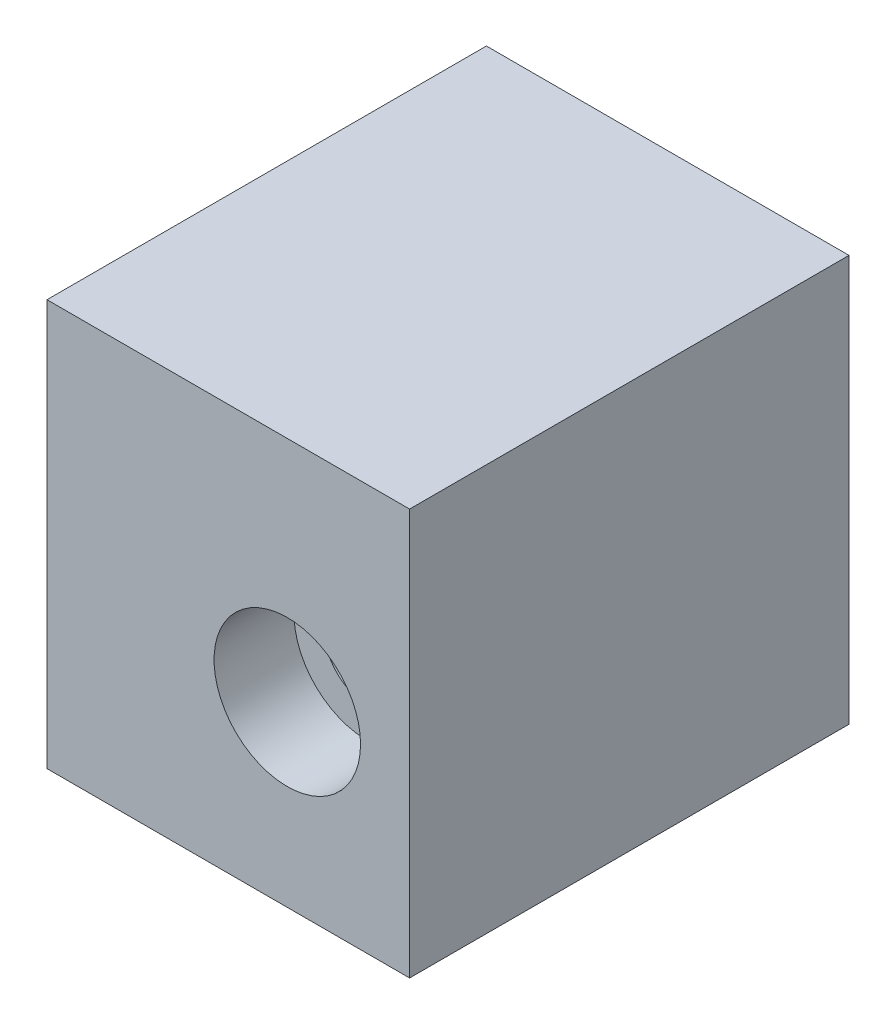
ISO-10303-21;
HEADER;
FILE_DESCRIPTION(('STEP AP214'),'2;1');
FILE_NAME('part.step','',(''),(''),'','','');
FILE_SCHEMA(('AUTOMOTIVE_DESIGN { 1 0 10303 214 1 1 1 1 }'));
ENDSEC;
DATA;
#1=APPLICATION_CONTEXT('core data for automotive mechanical design processes');
#2=APPLICATION_PROTOCOL_DEFINITION('international standard','automotive_design',2000,#1);
#3=PRODUCT_CONTEXT('',#1,'mechanical');
#4=PRODUCT('Part','Part','',(#3));
#5=PRODUCT_RELATED_PRODUCT_CATEGORY('part','',(#4));
#6=PRODUCT_DEFINITION_FORMATION('','',#4);
#7=PRODUCT_DEFINITION_CONTEXT('part definition',#1,'design');
#8=PRODUCT_DEFINITION('design','',#6,#7);
#9=PRODUCT_DEFINITION_SHAPE('','',#8);
#10=(LENGTH_UNIT() NAMED_UNIT(*) SI_UNIT(.MILLI.,.METRE.));
#11=(NAMED_UNIT(*) PLANE_ANGLE_UNIT() SI_UNIT($,.RADIAN.));
#12=(NAMED_UNIT(*) SI_UNIT($,.STERADIAN.) SOLID_ANGLE_UNIT());
#13=UNCERTAINTY_MEASURE_WITH_UNIT(LENGTH_MEASURE(1.E-05),#10,'distance_accuracy_value','');
#14=(GEOMETRIC_REPRESENTATION_CONTEXT(3) GLOBAL_UNCERTAINTY_ASSIGNED_CONTEXT((#13)) GLOBAL_UNIT_ASSIGNED_CONTEXT((#10,
#11,#12)) REPRESENTATION_CONTEXT('',''));
#15=CARTESIAN_POINT('',(0.,0.,0.));
#16=DIRECTION('',(0.,0.,1.));
#17=DIRECTION('',(1.,0.,0.));
#18=AXIS2_PLACEMENT_3D('',#15,#16,#17);
#19=CARTESIAN_POINT('',(-11.709746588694,12.662865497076,33.));
#20=DIRECTION('',(1.,0.,0.));
#21=DIRECTION('',(0.,0.,-1.));
#22=AXIS2_PLACEMENT_3D('',#19,#20,#21);
#23=PLANE('',#22);
#24=DIRECTION('',(0.,-1.,0.));
#25=VECTOR('',#24,1.);
#26=CARTESIAN_POINT('',(-11.709746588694,12.662865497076,0.));
#27=LINE('',#26,#25);
#28=CARTESIAN_POINT('',(-11.709746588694,12.662865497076,0.));
#29=VERTEX_POINT('',#28);
#30=CARTESIAN_POINT('',(-11.709746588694,-17.8369395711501,0.));
#31=VERTEX_POINT('',#30);
#32=EDGE_CURVE('E535',#29,#31,#27,.T.);
#33=ORIENTED_EDGE('',*,*,#32,.T.);
#34=DIRECTION('',(0.,0.,-1.));
#35=VECTOR('',#34,1.);
#36=CARTESIAN_POINT('',(-11.709746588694,-17.8369395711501,33.));
#37=LINE('',#36,#35);
#38=CARTESIAN_POINT('',(-11.709746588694,-17.8369395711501,33.));
#39=VERTEX_POINT('',#38);
#40=EDGE_CURVE('E11',#39,#31,#37,.T.);
#41=ORIENTED_EDGE('',*,*,#40,.F.);
#42=DIRECTION('',(0.,-1.,0.));
#43=VECTOR('',#42,1.);
#44=CARTESIAN_POINT('',(-11.709746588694,12.662865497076,33.));
#45=LINE('',#44,#43);
#46=CARTESIAN_POINT('',(-11.709746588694,12.662865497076,33.));
#47=VERTEX_POINT('',#46);
#48=EDGE_CURVE('E558',#47,#39,#45,.T.);
#49=ORIENTED_EDGE('',*,*,#48,.F.);
#50=DIRECTION('',(0.,0.,-1.));
#51=VECTOR('',#50,1.);
#52=CARTESIAN_POINT('',(-11.709746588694,12.662865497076,33.));
#53=LINE('',#52,#51);
#54=EDGE_CURVE('E547',#47,#29,#53,.T.);
#55=ORIENTED_EDGE('',*,*,#54,.T.);
#56=EDGE_LOOP('',(#33,#41,#49,#55));
#57=FACE_BOUND('',#56,.T.);
#58=ADVANCED_FACE('F491',(#57),#23,.F.);
#59=CARTESIAN_POINT('',(-11.709746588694,-17.8369395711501,33.));
#60=DIRECTION('',(0.,1.,0.));
#61=DIRECTION('',(0.,0.,1.));
#62=AXIS2_PLACEMENT_3D('',#59,#60,#61);
#63=PLANE('',#62);
#64=DIRECTION('',(1.,0.,0.));
#65=VECTOR('',#64,1.);
#66=CARTESIAN_POINT('',(-11.709746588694,-17.8369395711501,0.));
#67=LINE('',#66,#65);
#68=CARTESIAN_POINT('',(15.5222222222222,-17.8369395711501,0.));
#69=VERTEX_POINT('',#68);
#70=EDGE_CURVE('E531',#31,#69,#67,.T.);
#71=ORIENTED_EDGE('',*,*,#70,.T.);
#72=DIRECTION('',(0.,0.,-1.));
#73=VECTOR('',#72,1.);
#74=CARTESIAN_POINT('',(15.5222222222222,-17.8369395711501,33.));
#75=LINE('',#74,#73);
#76=CARTESIAN_POINT('',(15.5222222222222,-17.8369395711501,33.));
#77=VERTEX_POINT('',#76);
#78=EDGE_CURVE('E498',#77,#69,#75,.T.);
#79=ORIENTED_EDGE('',*,*,#78,.F.);
#80=DIRECTION('',(1.,0.,0.));
#81=VECTOR('',#80,1.);
#82=CARTESIAN_POINT('',(-11.709746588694,-17.8369395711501,33.));
#83=LINE('',#82,#81);
#84=EDGE_CURVE('E543',#39,#77,#83,.T.);
#85=ORIENTED_EDGE('',*,*,#84,.F.);
#86=ORIENTED_EDGE('',*,*,#40,.T.);
#87=EDGE_LOOP('',(#71,#79,#85,#86));
#88=FACE_BOUND('',#87,.T.);
#89=ADVANCED_FACE('F542',(#88),#63,.F.);
#90=CARTESIAN_POINT('',(15.5222222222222,12.662865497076,33.));
#91=DIRECTION('',(-1.,0.,0.));
#92=DIRECTION('',(0.,0.,1.));
#93=AXIS2_PLACEMENT_3D('',#90,#91,#92);
#94=PLANE('',#93);
#95=DIRECTION('',(0.,1.,0.));
#96=VECTOR('',#95,1.);
#97=CARTESIAN_POINT('',(15.5222222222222,12.662865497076,0.));
#98=LINE('',#97,#96);
#99=CARTESIAN_POINT('',(15.5222222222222,12.662865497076,0.));
#100=VERTEX_POINT('',#99);
#101=EDGE_CURVE('E536',#69,#100,#98,.T.);
#102=ORIENTED_EDGE('',*,*,#101,.T.);
#103=DIRECTION('',(0.,0.,-1.));
#104=VECTOR('',#103,1.);
#105=CARTESIAN_POINT('',(15.5222222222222,12.662865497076,33.));
#106=LINE('',#105,#104);
#107=CARTESIAN_POINT('',(15.5222222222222,12.662865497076,33.));
#108=VERTEX_POINT('',#107);
#109=EDGE_CURVE('E564',#108,#100,#106,.T.);
#110=ORIENTED_EDGE('',*,*,#109,.F.);
#111=DIRECTION('',(0.,1.,0.));
#112=VECTOR('',#111,1.);
#113=CARTESIAN_POINT('',(15.5222222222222,12.662865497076,33.));
#114=LINE('',#113,#112);
#115=EDGE_CURVE('E510',#77,#108,#114,.T.);
#116=ORIENTED_EDGE('',*,*,#115,.F.);
#117=ORIENTED_EDGE('',*,*,#78,.T.);
#118=EDGE_LOOP('',(#102,#110,#116,#117));
#119=FACE_BOUND('',#118,.T.);
#120=ADVANCED_FACE('F567',(#119),#94,.F.);
#121=CARTESIAN_POINT('',(-11.709746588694,12.662865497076,33.));
#122=DIRECTION('',(0.,-1.,0.));
#123=DIRECTION('',(0.,0.,-1.));
#124=AXIS2_PLACEMENT_3D('',#121,#122,#123);
#125=PLANE('',#124);
#126=DIRECTION('',(-1.,0.,0.));
#127=VECTOR('',#126,1.);
#128=CARTESIAN_POINT('',(-11.709746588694,12.662865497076,0.));
#129=LINE('',#128,#127);
#130=EDGE_CURVE('E556',#100,#29,#129,.T.);
#131=ORIENTED_EDGE('',*,*,#130,.T.);
#132=ORIENTED_EDGE('',*,*,#54,.F.);
#133=DIRECTION('',(-1.,0.,0.));
#134=VECTOR('',#133,1.);
#135=CARTESIAN_POINT('',(-11.709746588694,12.662865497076,33.));
#136=LINE('',#135,#134);
#137=EDGE_CURVE('E505',#108,#47,#136,.T.);
#138=ORIENTED_EDGE('',*,*,#137,.F.);
#139=ORIENTED_EDGE('',*,*,#109,.T.);
#140=EDGE_LOOP('',(#131,#132,#138,#139));
#141=FACE_BOUND('',#140,.T.);
#142=ADVANCED_FACE('F569',(#141),#125,.F.);
#143=CARTESIAN_POINT('',(-11.709746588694,-17.8369395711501,33.));
#144=DIRECTION('',(0.,0.,1.));
#145=DIRECTION('',(1.,0.,0.));
#146=AXIS2_PLACEMENT_3D('',#143,#144,#145);
#147=PLANE('',#146);
#148=CARTESIAN_POINT('',(6.3385437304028,-4.48000102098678,33.));
#149=DIRECTION('',(0.,0.,1.));
#150=DIRECTION('',(1.,0.,0.));
#151=AXIS2_PLACEMENT_3D('',#148,#149,#150);
#152=CIRCLE('',#151,5.49999999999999);
#153=CARTESIAN_POINT('',(11.8385437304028,-4.48000102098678,33.));
#154=VERTEX_POINT('',#153);
#155=EDGE_CURVE('E633',#154,#154,#152,.T.);
#156=ORIENTED_EDGE('',*,*,#155,.F.);
#157=EDGE_LOOP('',(#156));
#158=FACE_BOUND('',#157,.T.);
#159=ORIENTED_EDGE('',*,*,#48,.T.);
#160=ORIENTED_EDGE('',*,*,#84,.T.);
#161=ORIENTED_EDGE('',*,*,#115,.T.);
#162=ORIENTED_EDGE('',*,*,#137,.T.);
#163=EDGE_LOOP('',(#159,#160,#161,#162));
#164=FACE_BOUND('',#163,.T.);
#165=ADVANCED_FACE('F570',(#158,#164),#147,.T.);
#166=CARTESIAN_POINT('',(-11.709746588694,-17.8369395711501,0.));
#167=DIRECTION('',(0.,0.,1.));
#168=DIRECTION('',(1.,0.,0.));
#169=AXIS2_PLACEMENT_3D('',#166,#167,#168);
#170=PLANE('',#169);
#171=CARTESIAN_POINT('',(6.3385437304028,-4.48000102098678,0.));
#172=DIRECTION('',(0.,0.,1.));
#173=DIRECTION('',(1.,0.,0.));
#174=AXIS2_PLACEMENT_3D('',#171,#172,#173);
#175=CIRCLE('',#174,3.2);
#176=CARTESIAN_POINT('',(9.5385437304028,-4.48000102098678,0.));
#177=VERTEX_POINT('',#176);
#178=EDGE_CURVE('E548',#177,#177,#175,.T.);
#179=ORIENTED_EDGE('',*,*,#178,.T.);
#180=EDGE_LOOP('',(#179));
#181=FACE_BOUND('',#180,.T.);
#182=ORIENTED_EDGE('',*,*,#32,.F.);
#183=ORIENTED_EDGE('',*,*,#130,.F.);
#184=ORIENTED_EDGE('',*,*,#101,.F.);
#185=ORIENTED_EDGE('',*,*,#70,.F.);
#186=EDGE_LOOP('',(#182,#183,#184,#185));
#187=FACE_BOUND('',#186,.T.);
#188=ADVANCED_FACE('F532',(#181,#187),#170,.F.);
#189=CARTESIAN_POINT('',(6.3385437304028,-4.48000102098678,33.));
#190=DIRECTION('',(0.,0.,1.));
#191=DIRECTION('',(1.,0.,0.));
#192=AXIS2_PLACEMENT_3D('',#189,#190,#191);
#193=CYLINDRICAL_SURFACE('',#192,3.20000000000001);
#194=ORIENTED_EDGE('',*,*,#178,.F.);
#195=EDGE_LOOP('',(#194));
#196=FACE_BOUND('',#195,.T.);
#197=CARTESIAN_POINT('',(6.3385437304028,-4.48000102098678,27.));
#198=DIRECTION('',(0.,0.,1.));
#199=DIRECTION('',(1.,0.,0.));
#200=AXIS2_PLACEMENT_3D('',#197,#198,#199);
#201=CIRCLE('',#200,3.20000000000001);
#202=CARTESIAN_POINT('',(9.53854373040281,-4.48000102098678,27.));
#203=VERTEX_POINT('',#202);
#204=EDGE_CURVE('E551',#203,#203,#201,.T.);
#205=ORIENTED_EDGE('',*,*,#204,.T.);
#206=EDGE_LOOP('',(#205));
#207=FACE_BOUND('',#206,.T.);
#208=ADVANCED_FACE('F578',(#196,#207),#193,.F.);
#209=CARTESIAN_POINT('',(9.53854373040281,-4.48000102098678,27.));
#210=DIRECTION('',(0.,0.,-1.));
#211=DIRECTION('',(-1.,0.,0.));
#212=AXIS2_PLACEMENT_3D('',#209,#210,#211);
#213=PLANE('',#212);
#214=ORIENTED_EDGE('',*,*,#204,.F.);
#215=EDGE_LOOP('',(#214));
#216=FACE_BOUND('',#215,.T.);
#217=CARTESIAN_POINT('',(6.3385437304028,-4.48000102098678,27.));
#218=DIRECTION('',(0.,0.,1.));
#219=DIRECTION('',(1.,0.,0.));
#220=AXIS2_PLACEMENT_3D('',#217,#218,#219);
#221=CIRCLE('',#220,5.5);
#222=CARTESIAN_POINT('',(11.8385437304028,-4.48000102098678,27.));
#223=VERTEX_POINT('',#222);
#224=EDGE_CURVE('E631',#223,#223,#221,.T.);
#225=ORIENTED_EDGE('',*,*,#224,.T.);
#226=EDGE_LOOP('',(#225));
#227=FACE_BOUND('',#226,.T.);
#228=ADVANCED_FACE('F610',(#216,#227),#213,.F.);
#229=CARTESIAN_POINT('',(6.3385437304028,-4.48000102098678,33.));
#230=DIRECTION('',(0.,0.,1.));
#231=DIRECTION('',(1.,0.,0.));
#232=AXIS2_PLACEMENT_3D('',#229,#230,#231);
#233=CYLINDRICAL_SURFACE('',#232,5.5);
#234=ORIENTED_EDGE('',*,*,#224,.F.);
#235=EDGE_LOOP('',(#234));
#236=FACE_BOUND('',#235,.T.);
#237=ORIENTED_EDGE('',*,*,#155,.T.);
#238=EDGE_LOOP('',(#237));
#239=FACE_BOUND('',#238,.T.);
#240=ADVANCED_FACE('F618',(#236,#239),#233,.F.);
#241=CLOSED_SHELL('',(#58,#89,#120,#142,#165,#188,#208,#228,#240));
#242=MANIFOLD_SOLID_BREP('B2',#241);
#243=ADVANCED_BREP_SHAPE_REPRESENTATION('',(#18,#242),#14);
#244=SHAPE_DEFINITION_REPRESENTATION(#9,#243);
ENDSEC;
END-ISO-10303-21;
